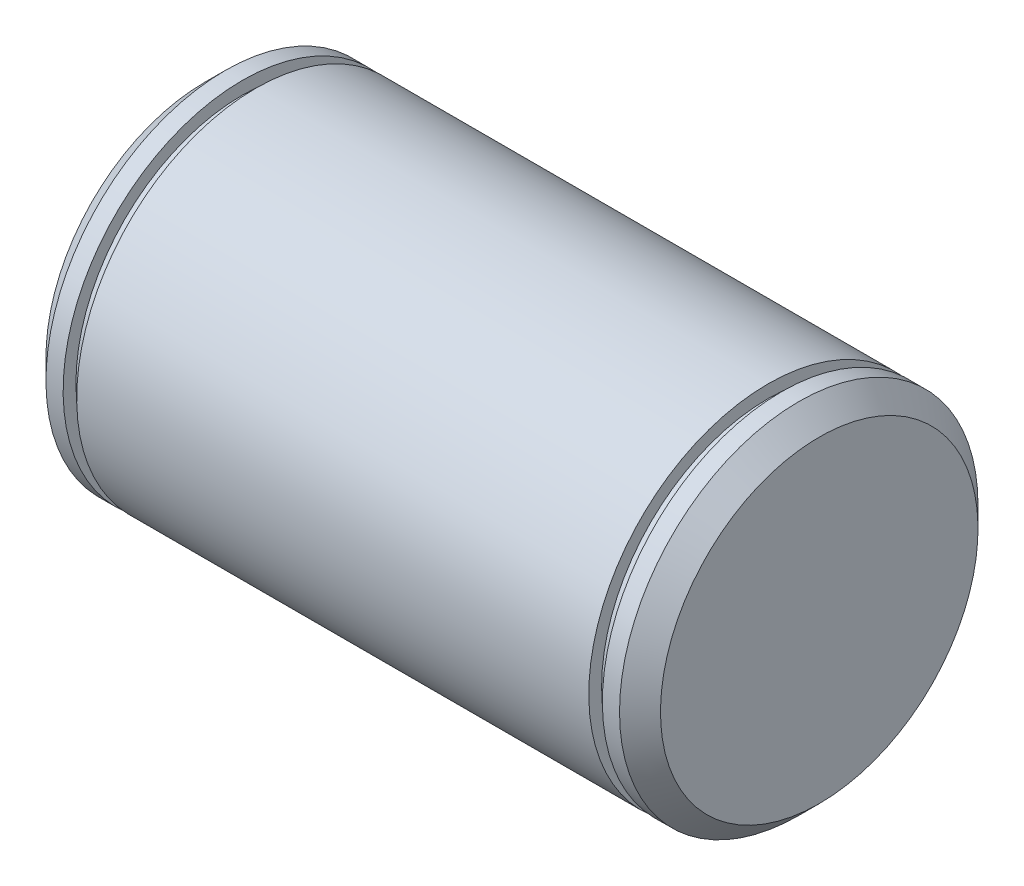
ISO-10303-21;
HEADER;
FILE_DESCRIPTION(('STEP AP214'),'2;1');
FILE_NAME('part.step','',(''),(''),'','','');
FILE_SCHEMA(('AUTOMOTIVE_DESIGN { 1 0 10303 214 1 1 1 1 }'));
ENDSEC;
DATA;
#1=APPLICATION_CONTEXT('core data for automotive mechanical design processes');
#2=APPLICATION_PROTOCOL_DEFINITION('international standard','automotive_design',2000,#1);
#3=PRODUCT_CONTEXT('',#1,'mechanical');
#4=PRODUCT('Part','Part','',(#3));
#5=PRODUCT_RELATED_PRODUCT_CATEGORY('part','',(#4));
#6=PRODUCT_DEFINITION_FORMATION('','',#4);
#7=PRODUCT_DEFINITION_CONTEXT('part definition',#1,'design');
#8=PRODUCT_DEFINITION('design','',#6,#7);
#9=PRODUCT_DEFINITION_SHAPE('','',#8);
#10=(LENGTH_UNIT() NAMED_UNIT(*) SI_UNIT(.MILLI.,.METRE.));
#11=(NAMED_UNIT(*) PLANE_ANGLE_UNIT() SI_UNIT($,.RADIAN.));
#12=(NAMED_UNIT(*) SI_UNIT($,.STERADIAN.) SOLID_ANGLE_UNIT());
#13=UNCERTAINTY_MEASURE_WITH_UNIT(LENGTH_MEASURE(1.E-05),#10,'distance_accuracy_value','');
#14=(GEOMETRIC_REPRESENTATION_CONTEXT(3) GLOBAL_UNCERTAINTY_ASSIGNED_CONTEXT((#13)) GLOBAL_UNIT_ASSIGNED_CONTEXT((#10,
#11,#12)) REPRESENTATION_CONTEXT('',''));
#15=CARTESIAN_POINT('',(0.,0.,0.));
#16=DIRECTION('',(0.,0.,1.));
#17=DIRECTION('',(1.,0.,0.));
#18=AXIS2_PLACEMENT_3D('',#15,#16,#17);
#19=CARTESIAN_POINT('',(89.498607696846,17.5,0.));
#20=DIRECTION('',(1.,0.,0.));
#21=DIRECTION('',(0.,0.,-1.));
#22=AXIS2_PLACEMENT_3D('',#19,#20,#21);
#23=PLANE('',#22);
#24=CARTESIAN_POINT('',(89.4986076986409,0.,0.));
#25=DIRECTION('',(-1.,0.,0.));
#26=DIRECTION('',(0.,-1.,0.));
#27=AXIS2_PLACEMENT_3D('',#24,#25,#26);
#28=CIRCLE('',#27,31.0000000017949);
#29=CARTESIAN_POINT('',(89.4986076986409,-31.0000000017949,0.));
#30=VERTEX_POINT('',#29);
#31=EDGE_CURVE('E18',#30,#30,#28,.T.);
#32=ORIENTED_EDGE('',*,*,#31,.F.);
#33=EDGE_LOOP('',(#32));
#34=FACE_BOUND('',#33,.T.);
#35=ADVANCED_FACE('F14',(#34),#23,.T.);
#36=CARTESIAN_POINT('',(-30.501392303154,17.5,0.));
#37=DIRECTION('',(-1.,0.,0.));
#38=DIRECTION('',(0.,0.,1.));
#39=AXIS2_PLACEMENT_3D('',#36,#37,#38);
#40=PLANE('',#39);
#41=CARTESIAN_POINT('',(-30.5013923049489,0.,0.));
#42=DIRECTION('',(1.,0.,0.));
#43=DIRECTION('',(0.,1.,0.));
#44=AXIS2_PLACEMENT_3D('',#41,#42,#43);
#45=CIRCLE('',#44,31.0000000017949);
#46=CARTESIAN_POINT('',(-30.5013923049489,31.0000000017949,0.));
#47=VERTEX_POINT('',#46);
#48=EDGE_CURVE('E50',#47,#47,#45,.T.);
#49=ORIENTED_EDGE('',*,*,#48,.F.);
#50=EDGE_LOOP('',(#49));
#51=FACE_BOUND('',#50,.T.);
#52=ADVANCED_FACE('F61',(#51),#40,.T.);
#53=CARTESIAN_POINT('',(85.4986076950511,0.,0.));
#54=DIRECTION('',(-1.,0.,0.));
#55=DIRECTION('',(0.,-1.,0.));
#56=AXIS2_PLACEMENT_3D('',#53,#54,#55);
#57=CONICAL_SURFACE('',#56,34.9999999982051,0.7853981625);
#58=CARTESIAN_POINT('',(85.498607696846,0.,0.));
#59=DIRECTION('',(1.,0.,0.));
#60=DIRECTION('',(0.,1.,0.));
#61=AXIS2_PLACEMENT_3D('',#58,#59,#60);
#62=CIRCLE('',#61,35.);
#63=CARTESIAN_POINT('',(85.498607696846,35.,0.));
#64=VERTEX_POINT('',#63);
#65=EDGE_CURVE('E30',#64,#64,#62,.F.);
#66=ORIENTED_EDGE('',*,*,#65,.F.);
#67=EDGE_LOOP('',(#66));
#68=FACE_BOUND('',#67,.T.);
#69=ORIENTED_EDGE('',*,*,#31,.T.);
#70=EDGE_LOOP('',(#69));
#71=FACE_BOUND('',#70,.T.);
#72=ADVANCED_FACE('F58',(#68,#71),#57,.T.);
#73=CARTESIAN_POINT('',(-26.5013923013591,0.,0.));
#74=DIRECTION('',(1.,0.,0.));
#75=DIRECTION('',(0.,1.,0.));
#76=AXIS2_PLACEMENT_3D('',#73,#74,#75);
#77=CONICAL_SURFACE('',#76,34.9999999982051,0.7853981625);
#78=ORIENTED_EDGE('',*,*,#48,.T.);
#79=EDGE_LOOP('',(#78));
#80=FACE_BOUND('',#79,.T.);
#81=CARTESIAN_POINT('',(-26.501392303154,0.,0.));
#82=DIRECTION('',(1.,0.,0.));
#83=DIRECTION('',(0.,1.,0.));
#84=AXIS2_PLACEMENT_3D('',#81,#82,#83);
#85=CIRCLE('',#84,35.);
#86=CARTESIAN_POINT('',(-26.501392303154,35.,0.));
#87=VERTEX_POINT('',#86);
#88=EDGE_CURVE('E49',#87,#87,#85,.T.);
#89=ORIENTED_EDGE('',*,*,#88,.F.);
#90=EDGE_LOOP('',(#89));
#91=FACE_BOUND('',#90,.T.);
#92=ADVANCED_FACE('F105',(#80,#91),#77,.T.);
#93=CARTESIAN_POINT('',(85.823607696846,0.,0.));
#94=DIRECTION('',(1.,0.,0.));
#95=DIRECTION('',(0.,1.,0.));
#96=AXIS2_PLACEMENT_3D('',#93,#94,#95);
#97=CYLINDRICAL_SURFACE('',#96,35.);
#98=ORIENTED_EDGE('',*,*,#65,.T.);
#99=EDGE_LOOP('',(#98));
#100=FACE_BOUND('',#99,.T.);
#101=CARTESIAN_POINT('',(82.148607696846,0.,0.));
#102=DIRECTION('',(1.,0.,0.));
#103=DIRECTION('',(0.,1.,0.));
#104=AXIS2_PLACEMENT_3D('',#101,#102,#103);
#105=CIRCLE('',#104,35.);
#106=CARTESIAN_POINT('',(82.148607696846,35.,0.));
#107=VERTEX_POINT('',#106);
#108=EDGE_CURVE('E47',#107,#107,#105,.F.);
#109=ORIENTED_EDGE('',*,*,#108,.F.);
#110=EDGE_LOOP('',(#109));
#111=FACE_BOUND('',#110,.T.);
#112=ADVANCED_FACE('F101',(#100,#111),#97,.T.);
#113=CARTESIAN_POINT('',(-26.826392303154,0.,0.));
#114=DIRECTION('',(1.,0.,0.));
#115=DIRECTION('',(0.,1.,0.));
#116=AXIS2_PLACEMENT_3D('',#113,#114,#115);
#117=CYLINDRICAL_SURFACE('',#116,35.);
#118=CARTESIAN_POINT('',(-23.151392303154,0.,0.));
#119=DIRECTION('',(1.,0.,0.));
#120=DIRECTION('',(0.,1.,0.));
#121=AXIS2_PLACEMENT_3D('',#118,#119,#120);
#122=CIRCLE('',#121,35.);
#123=CARTESIAN_POINT('',(-23.151392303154,35.,0.));
#124=VERTEX_POINT('',#123);
#125=EDGE_CURVE('E44',#124,#124,#122,.T.);
#126=ORIENTED_EDGE('',*,*,#125,.F.);
#127=EDGE_LOOP('',(#126));
#128=FACE_BOUND('',#127,.T.);
#129=ORIENTED_EDGE('',*,*,#88,.T.);
#130=EDGE_LOOP('',(#129));
#131=FACE_BOUND('',#130,.T.);
#132=ADVANCED_FACE('F97',(#128,#131),#117,.T.);
#133=CARTESIAN_POINT('',(82.148607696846,33.75,0.));
#134=DIRECTION('',(-1.,0.,0.));
#135=DIRECTION('',(0.,0.,1.));
#136=AXIS2_PLACEMENT_3D('',#133,#134,#135);
#137=PLANE('',#136);
#138=CARTESIAN_POINT('',(82.148607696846,0.,0.));
#139=DIRECTION('',(1.,0.,0.));
#140=DIRECTION('',(0.,1.,0.));
#141=AXIS2_PLACEMENT_3D('',#138,#139,#140);
#142=CIRCLE('',#141,32.5);
#143=CARTESIAN_POINT('',(82.148607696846,32.5,0.));
#144=VERTEX_POINT('',#143);
#145=EDGE_CURVE('E41',#144,#144,#142,.F.);
#146=ORIENTED_EDGE('',*,*,#145,.F.);
#147=EDGE_LOOP('',(#146));
#148=FACE_BOUND('',#147,.T.);
#149=ORIENTED_EDGE('',*,*,#108,.T.);
#150=EDGE_LOOP('',(#149));
#151=FACE_BOUND('',#150,.T.);
#152=ADVANCED_FACE('F93',(#148,#151),#137,.T.);
#153=CARTESIAN_POINT('',(-23.151392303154,33.75,0.));
#154=DIRECTION('',(1.,0.,0.));
#155=DIRECTION('',(0.,0.,-1.));
#156=AXIS2_PLACEMENT_3D('',#153,#154,#155);
#157=PLANE('',#156);
#158=CARTESIAN_POINT('',(-23.151392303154,0.,0.));
#159=DIRECTION('',(1.,0.,0.));
#160=DIRECTION('',(0.,1.,0.));
#161=AXIS2_PLACEMENT_3D('',#158,#159,#160);
#162=CIRCLE('',#161,32.5);
#163=CARTESIAN_POINT('',(-23.151392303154,32.5,0.));
#164=VERTEX_POINT('',#163);
#165=EDGE_CURVE('E38',#164,#164,#162,.T.);
#166=ORIENTED_EDGE('',*,*,#165,.F.);
#167=EDGE_LOOP('',(#166));
#168=FACE_BOUND('',#167,.T.);
#169=ORIENTED_EDGE('',*,*,#125,.T.);
#170=EDGE_LOOP('',(#169));
#171=FACE_BOUND('',#170,.T.);
#172=ADVANCED_FACE('F89',(#168,#171),#157,.T.);
#173=CARTESIAN_POINT('',(80.823607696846,0.,0.));
#174=DIRECTION('',(1.,0.,0.));
#175=DIRECTION('',(0.,1.,0.));
#176=AXIS2_PLACEMENT_3D('',#173,#174,#175);
#177=CYLINDRICAL_SURFACE('',#176,32.5);
#178=ORIENTED_EDGE('',*,*,#145,.T.);
#179=EDGE_LOOP('',(#178));
#180=FACE_BOUND('',#179,.T.);
#181=CARTESIAN_POINT('',(79.498607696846,0.,0.));
#182=DIRECTION('',(1.,0.,0.));
#183=DIRECTION('',(0.,1.,0.));
#184=AXIS2_PLACEMENT_3D('',#181,#182,#183);
#185=CIRCLE('',#184,32.5);
#186=CARTESIAN_POINT('',(79.498607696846,32.5,0.));
#187=VERTEX_POINT('',#186);
#188=EDGE_CURVE('E35',#187,#187,#185,.F.);
#189=ORIENTED_EDGE('',*,*,#188,.F.);
#190=EDGE_LOOP('',(#189));
#191=FACE_BOUND('',#190,.T.);
#192=ADVANCED_FACE('F83',(#180,#191),#177,.T.);
#193=CARTESIAN_POINT('',(-21.826392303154,0.,0.));
#194=DIRECTION('',(1.,0.,0.));
#195=DIRECTION('',(0.,1.,0.));
#196=AXIS2_PLACEMENT_3D('',#193,#194,#195);
#197=CYLINDRICAL_SURFACE('',#196,32.5);
#198=CARTESIAN_POINT('',(-20.501392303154,0.,0.));
#199=DIRECTION('',(1.,0.,0.));
#200=DIRECTION('',(0.,1.,0.));
#201=AXIS2_PLACEMENT_3D('',#198,#199,#200);
#202=CIRCLE('',#201,32.5);
#203=CARTESIAN_POINT('',(-20.501392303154,32.5,0.));
#204=VERTEX_POINT('',#203);
#205=EDGE_CURVE('E27',#204,#204,#202,.T.);
#206=ORIENTED_EDGE('',*,*,#205,.F.);
#207=EDGE_LOOP('',(#206));
#208=FACE_BOUND('',#207,.T.);
#209=ORIENTED_EDGE('',*,*,#165,.T.);
#210=EDGE_LOOP('',(#209));
#211=FACE_BOUND('',#210,.T.);
#212=ADVANCED_FACE('F78',(#208,#211),#197,.T.);
#213=CARTESIAN_POINT('',(79.498607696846,33.75,0.));
#214=DIRECTION('',(1.,0.,0.));
#215=DIRECTION('',(0.,0.,-1.));
#216=AXIS2_PLACEMENT_3D('',#213,#214,#215);
#217=PLANE('',#216);
#218=ORIENTED_EDGE('',*,*,#188,.T.);
#219=EDGE_LOOP('',(#218));
#220=FACE_BOUND('',#219,.T.);
#221=CARTESIAN_POINT('',(79.498607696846,0.,0.));
#222=DIRECTION('',(1.,0.,0.));
#223=DIRECTION('',(0.,1.,0.));
#224=AXIS2_PLACEMENT_3D('',#221,#222,#223);
#225=CIRCLE('',#224,35.);
#226=CARTESIAN_POINT('',(79.498607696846,35.,0.));
#227=VERTEX_POINT('',#226);
#228=EDGE_CURVE('E22',#227,#227,#225,.F.);
#229=ORIENTED_EDGE('',*,*,#228,.F.);
#230=EDGE_LOOP('',(#229));
#231=FACE_BOUND('',#230,.T.);
#232=ADVANCED_FACE('F73',(#220,#231),#217,.T.);
#233=CARTESIAN_POINT('',(-20.501392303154,33.75,0.));
#234=DIRECTION('',(-1.,0.,0.));
#235=DIRECTION('',(0.,0.,1.));
#236=AXIS2_PLACEMENT_3D('',#233,#234,#235);
#237=PLANE('',#236);
#238=ORIENTED_EDGE('',*,*,#205,.T.);
#239=EDGE_LOOP('',(#238));
#240=FACE_BOUND('',#239,.T.);
#241=CARTESIAN_POINT('',(-20.501392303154,0.,0.));
#242=DIRECTION('',(1.,0.,0.));
#243=DIRECTION('',(0.,1.,0.));
#244=AXIS2_PLACEMENT_3D('',#241,#242,#243);
#245=CIRCLE('',#244,35.);
#246=CARTESIAN_POINT('',(-20.501392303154,35.,0.));
#247=VERTEX_POINT('',#246);
#248=EDGE_CURVE('E9',#247,#247,#245,.T.);
#249=ORIENTED_EDGE('',*,*,#248,.F.);
#250=EDGE_LOOP('',(#249));
#251=FACE_BOUND('',#250,.T.);
#252=ADVANCED_FACE('F69',(#240,#251),#237,.T.);
#253=CARTESIAN_POINT('',(29.498607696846,0.,0.));
#254=DIRECTION('',(1.,0.,0.));
#255=DIRECTION('',(0.,1.,0.));
#256=AXIS2_PLACEMENT_3D('',#253,#254,#255);
#257=CYLINDRICAL_SURFACE('',#256,35.);
#258=ORIENTED_EDGE('',*,*,#228,.T.);
#259=EDGE_LOOP('',(#258));
#260=FACE_BOUND('',#259,.T.);
#261=ORIENTED_EDGE('',*,*,#248,.T.);
#262=EDGE_LOOP('',(#261));
#263=FACE_BOUND('',#262,.T.);
#264=ADVANCED_FACE('F16',(#260,#263),#257,.T.);
#265=CLOSED_SHELL('',(#35,#52,#72,#92,#112,#132,#152,#172,#192,#212,#232,#252,#264));
#266=MANIFOLD_SOLID_BREP('B1',#265);
#267=ADVANCED_BREP_SHAPE_REPRESENTATION('',(#18,#266),#14);
#268=SHAPE_DEFINITION_REPRESENTATION(#9,#267);
ENDSEC;
END-ISO-10303-21;
